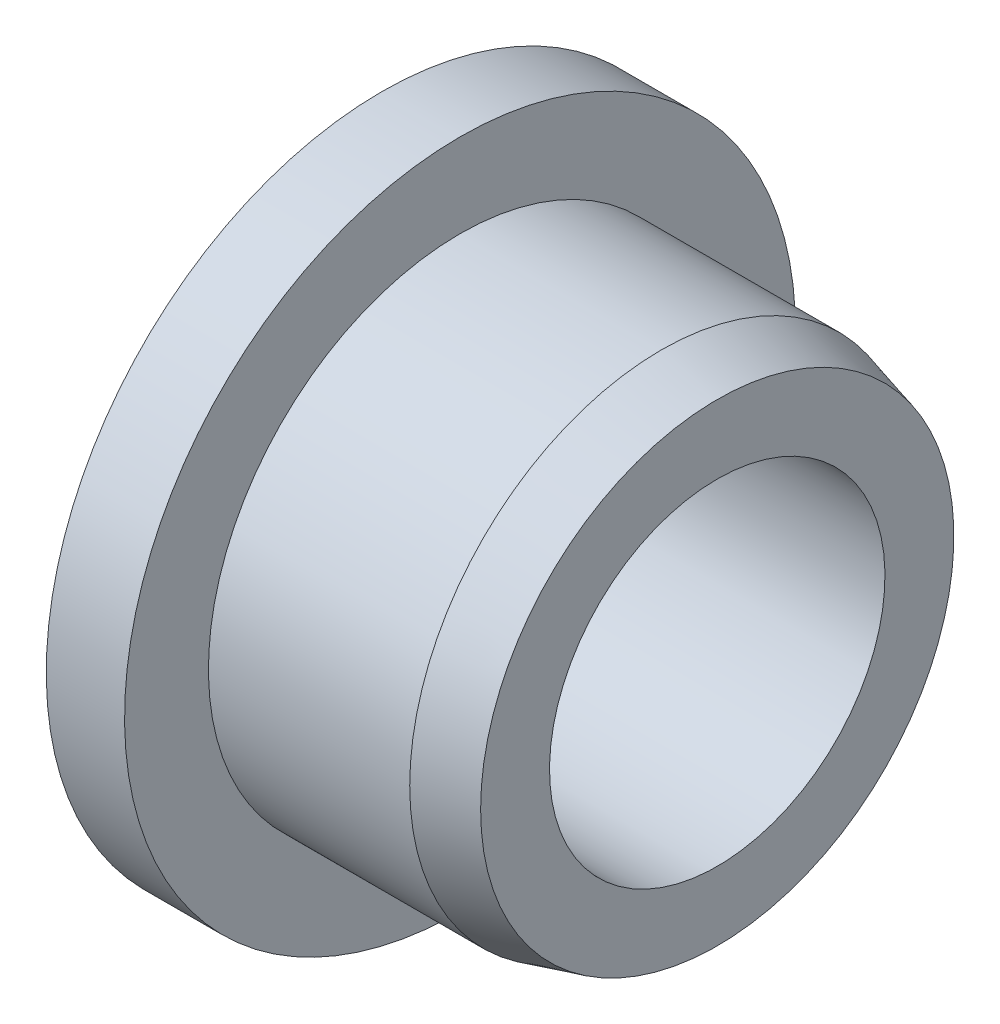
ISO-10303-21;
HEADER;
FILE_DESCRIPTION(('STEP AP214'),'2;1');
FILE_NAME('part.step','',(''),(''),'','','');
FILE_SCHEMA(('AUTOMOTIVE_DESIGN { 1 0 10303 214 1 1 1 1 }'));
ENDSEC;
DATA;
#1=APPLICATION_CONTEXT('core data for automotive mechanical design processes');
#2=APPLICATION_PROTOCOL_DEFINITION('international standard','automotive_design',2000,#1);
#3=PRODUCT_CONTEXT('',#1,'mechanical');
#4=PRODUCT('Part','Part','',(#3));
#5=PRODUCT_RELATED_PRODUCT_CATEGORY('part','',(#4));
#6=PRODUCT_DEFINITION_FORMATION('','',#4);
#7=PRODUCT_DEFINITION_CONTEXT('part definition',#1,'design');
#8=PRODUCT_DEFINITION('design','',#6,#7);
#9=PRODUCT_DEFINITION_SHAPE('','',#8);
#10=(LENGTH_UNIT() NAMED_UNIT(*) SI_UNIT(.MILLI.,.METRE.));
#11=(NAMED_UNIT(*) PLANE_ANGLE_UNIT() SI_UNIT($,.RADIAN.));
#12=(NAMED_UNIT(*) SI_UNIT($,.STERADIAN.) SOLID_ANGLE_UNIT());
#13=UNCERTAINTY_MEASURE_WITH_UNIT(LENGTH_MEASURE(1.E-05),#10,'distance_accuracy_value','');
#14=(GEOMETRIC_REPRESENTATION_CONTEXT(3) GLOBAL_UNCERTAINTY_ASSIGNED_CONTEXT((#13)) GLOBAL_UNIT_ASSIGNED_CONTEXT((#10,
#11,#12)) REPRESENTATION_CONTEXT('',''));
#15=CARTESIAN_POINT('',(0.,0.,0.));
#16=DIRECTION('',(0.,0.,1.));
#17=DIRECTION('',(1.,0.,0.));
#18=AXIS2_PLACEMENT_3D('',#15,#16,#17);
#19=CARTESIAN_POINT('',(4.99999999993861,0.,0.));
#20=DIRECTION('',(-1.,0.,0.));
#21=DIRECTION('',(0.,0.,1.));
#22=AXIS2_PLACEMENT_3D('',#19,#20,#21);
#23=CONICAL_SURFACE('',#22,4.50000000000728,0.261799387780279);
#24=CARTESIAN_POINT('',(4.99999999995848,0.,0.));
#25=DIRECTION('',(1.,0.,0.));
#26=DIRECTION('',(0.,1.,0.));
#27=AXIS2_PLACEMENT_3D('',#24,#25,#26);
#28=CIRCLE('',#27,4.5);
#29=CARTESIAN_POINT('',(4.99999999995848,4.5,0.));
#30=VERTEX_POINT('',#29);
#31=EDGE_CURVE('E29',#30,#30,#28,.F.);
#32=ORIENTED_EDGE('',*,*,#31,.F.);
#33=EDGE_LOOP('',(#32));
#34=FACE_BOUND('',#33,.T.);
#35=CARTESIAN_POINT('',(5.99999999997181,0.,0.));
#36=DIRECTION('',(-1.,0.,0.));
#37=DIRECTION('',(0.,0.,1.));
#38=AXIS2_PLACEMENT_3D('',#35,#36,#37);
#39=CIRCLE('',#38,4.23205080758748);
#40=CARTESIAN_POINT('',(5.99999999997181,0.,4.23205080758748));
#41=VERTEX_POINT('',#40);
#42=EDGE_CURVE('E17',#41,#41,#39,.F.);
#43=ORIENTED_EDGE('',*,*,#42,.F.);
#44=EDGE_LOOP('',(#43));
#45=FACE_BOUND('',#44,.T.);
#46=ADVANCED_FACE('F14',(#34,#45),#23,.T.);
#47=CARTESIAN_POINT('',(-0.299999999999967,0.,0.));
#48=DIRECTION('',(1.,0.,0.));
#49=DIRECTION('',(0.,1.,0.));
#50=AXIS2_PLACEMENT_3D('',#47,#48,#49);
#51=CYLINDRICAL_SURFACE('',#50,4.5);
#52=ORIENTED_EDGE('',*,*,#31,.T.);
#53=EDGE_LOOP('',(#52));
#54=FACE_BOUND('',#53,.T.);
#55=CARTESIAN_POINT('',(1.39999999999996,0.,0.));
#56=DIRECTION('',(1.,0.,0.));
#57=DIRECTION('',(0.,1.,0.));
#58=AXIS2_PLACEMENT_3D('',#55,#56,#57);
#59=CIRCLE('',#58,4.5);
#60=CARTESIAN_POINT('',(1.39999999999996,4.5,0.));
#61=VERTEX_POINT('',#60);
#62=EDGE_CURVE('E35',#61,#61,#59,.F.);
#63=ORIENTED_EDGE('',*,*,#62,.F.);
#64=EDGE_LOOP('',(#63));
#65=FACE_BOUND('',#64,.T.);
#66=ADVANCED_FACE('F45',(#54,#65),#51,.T.);
#67=CARTESIAN_POINT('',(6.00000000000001,0.,0.));
#68=DIRECTION('',(1.,0.,0.));
#69=DIRECTION('',(0.,1.,0.));
#70=AXIS2_PLACEMENT_3D('',#67,#68,#69);
#71=PLANE('',#70);
#72=ORIENTED_EDGE('',*,*,#42,.T.);
#73=EDGE_LOOP('',(#72));
#74=FACE_BOUND('',#73,.T.);
#75=CARTESIAN_POINT('',(6.00000000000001,0.,0.));
#76=DIRECTION('',(1.,0.,0.));
#77=DIRECTION('',(0.,1.,0.));
#78=AXIS2_PLACEMENT_3D('',#75,#76,#77);
#79=CIRCLE('',#78,3.);
#80=CARTESIAN_POINT('',(6.00000000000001,3.,0.));
#81=VERTEX_POINT('',#80);
#82=EDGE_CURVE('E33',#81,#81,#79,.F.);
#83=ORIENTED_EDGE('',*,*,#82,.T.);
#84=EDGE_LOOP('',(#83));
#85=FACE_BOUND('',#84,.T.);
#86=ADVANCED_FACE('F54',(#74,#85),#71,.T.);
#87=CARTESIAN_POINT('',(1.39999999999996,0.,0.));
#88=DIRECTION('',(1.,0.,0.));
#89=DIRECTION('',(0.,1.,0.));
#90=AXIS2_PLACEMENT_3D('',#87,#88,#89);
#91=PLANE('',#90);
#92=CARTESIAN_POINT('',(1.39999999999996,0.,0.));
#93=DIRECTION('',(1.,0.,0.));
#94=DIRECTION('',(0.,1.,0.));
#95=AXIS2_PLACEMENT_3D('',#92,#93,#94);
#96=CIRCLE('',#95,6.);
#97=CARTESIAN_POINT('',(1.39999999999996,6.,0.));
#98=VERTEX_POINT('',#97);
#99=EDGE_CURVE('E26',#98,#98,#96,.F.);
#100=ORIENTED_EDGE('',*,*,#99,.F.);
#101=EDGE_LOOP('',(#100));
#102=FACE_BOUND('',#101,.T.);
#103=ORIENTED_EDGE('',*,*,#62,.T.);
#104=EDGE_LOOP('',(#103));
#105=FACE_BOUND('',#104,.T.);
#106=ADVANCED_FACE('F70',(#102,#105),#91,.T.);
#107=CARTESIAN_POINT('',(-0.299999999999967,0.,0.));
#108=DIRECTION('',(1.,0.,0.));
#109=DIRECTION('',(0.,1.,0.));
#110=AXIS2_PLACEMENT_3D('',#107,#108,#109);
#111=CYLINDRICAL_SURFACE('',#110,3.);
#112=ORIENTED_EDGE('',*,*,#82,.F.);
#113=EDGE_LOOP('',(#112));
#114=FACE_BOUND('',#113,.T.);
#115=CARTESIAN_POINT('',(0.,0.,0.));
#116=DIRECTION('',(1.,0.,0.));
#117=DIRECTION('',(0.,1.,0.));
#118=AXIS2_PLACEMENT_3D('',#115,#116,#117);
#119=CIRCLE('',#118,3.);
#120=CARTESIAN_POINT('',(0.,3.,0.));
#121=VERTEX_POINT('',#120);
#122=EDGE_CURVE('E21',#121,#121,#119,.F.);
#123=ORIENTED_EDGE('',*,*,#122,.T.);
#124=EDGE_LOOP('',(#123));
#125=FACE_BOUND('',#124,.T.);
#126=ADVANCED_FACE('F63',(#114,#125),#111,.F.);
#127=CARTESIAN_POINT('',(-0.299999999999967,0.,0.));
#128=DIRECTION('',(1.,0.,0.));
#129=DIRECTION('',(0.,1.,0.));
#130=AXIS2_PLACEMENT_3D('',#127,#128,#129);
#131=CYLINDRICAL_SURFACE('',#130,6.);
#132=ORIENTED_EDGE('',*,*,#99,.T.);
#133=EDGE_LOOP('',(#132));
#134=FACE_BOUND('',#133,.T.);
#135=CARTESIAN_POINT('',(0.,0.,0.));
#136=DIRECTION('',(1.,0.,0.));
#137=DIRECTION('',(0.,1.,0.));
#138=AXIS2_PLACEMENT_3D('',#135,#136,#137);
#139=CIRCLE('',#138,6.);
#140=CARTESIAN_POINT('',(0.,6.,0.));
#141=VERTEX_POINT('',#140);
#142=EDGE_CURVE('E10',#141,#141,#139,.T.);
#143=ORIENTED_EDGE('',*,*,#142,.T.);
#144=EDGE_LOOP('',(#143));
#145=FACE_BOUND('',#144,.T.);
#146=ADVANCED_FACE('F57',(#134,#145),#131,.T.);
#147=CARTESIAN_POINT('',(0.,0.,0.));
#148=DIRECTION('',(1.,0.,0.));
#149=DIRECTION('',(0.,1.,0.));
#150=AXIS2_PLACEMENT_3D('',#147,#148,#149);
#151=PLANE('',#150);
#152=ORIENTED_EDGE('',*,*,#142,.F.);
#153=EDGE_LOOP('',(#152));
#154=FACE_BOUND('',#153,.T.);
#155=ORIENTED_EDGE('',*,*,#122,.F.);
#156=EDGE_LOOP('',(#155));
#157=FACE_BOUND('',#156,.T.);
#158=ADVANCED_FACE('F55',(#154,#157),#151,.F.);
#159=CLOSED_SHELL('',(#46,#66,#86,#106,#126,#146,#158));
#160=MANIFOLD_SOLID_BREP('B1',#159);
#161=ADVANCED_BREP_SHAPE_REPRESENTATION('',(#18,#160),#14);
#162=SHAPE_DEFINITION_REPRESENTATION(#9,#161);
ENDSEC;
END-ISO-10303-21;
